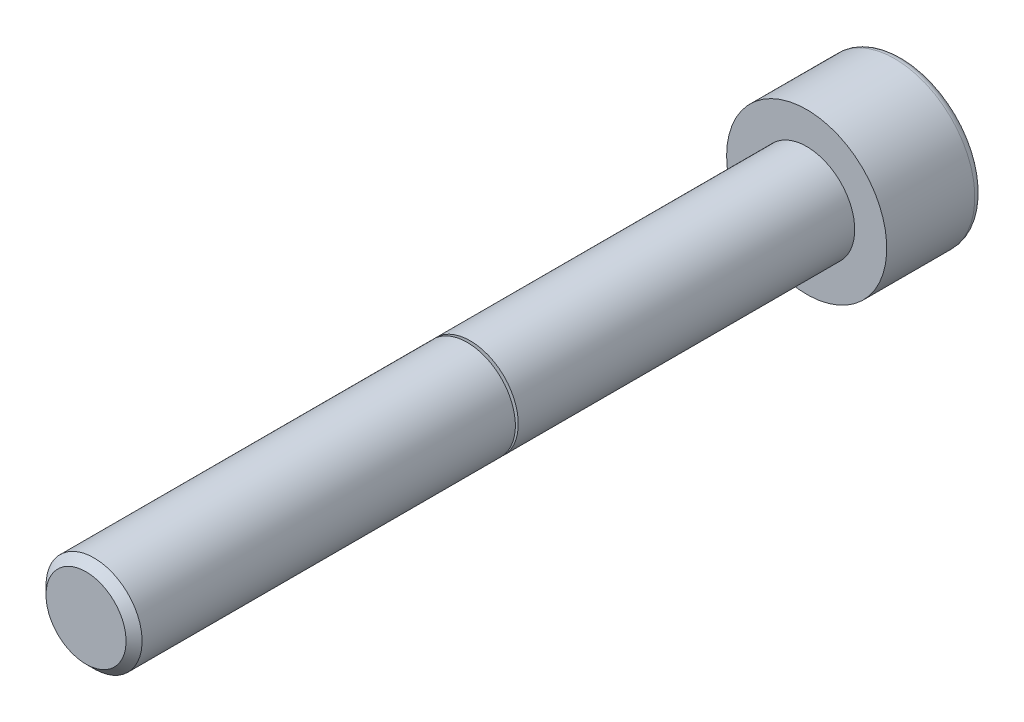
from build123d import *

# Parameters (mm, degrees)
CUT_EXTRUDE1_DEPTH = 2.5


with BuildPart() as part:
    # Logo3_bib1 → Revolve1 (revolve)
    with BuildSketch(Plane(origin=(0, 0, 0), x_dir=(-1, 0, 0), z_dir=(0, -1, 0))):
        with BuildLine():
            Line((0, -45), (0, 6))
            Line((0, 6), (4.5, 6))
            ThreePointArc((4.5, 6), (4.853553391, 5.853553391), (5, 5.5))
            Line((5, 5.5), (5, 0))
            Line((5, 0), (3, 0))
            Line((3, 0), (3, -21.01))
            Line((3, -21.01), (2.613425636, -21.01))
            ThreePointArc((2.613425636, -21.01), (2.593729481, -21.026527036), (2.606585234, -21.048793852))
            Line((2.606585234, -21.048793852), (3, -21.191985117))
            Line((3, -21.191985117), (3, -44.5))
            Line((3, -44.5), (2.5, -45))
            Line((2.5, -45), (0, -45))
        make_face()
    revolve(axis=Axis((0, 0, -10.585154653), (0, 0, 1)))

    # Logo3_bib2 → Cut-Extrude1 (cut)
    with BuildSketch(Plane(origin=(0, 0, -6), x_dir=(1, 0, 0), z_dir=(0, 0, -1))):
        Polygon((2.886751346, 0), (1.443375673, 2.5), (-1.443375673, 2.5), (-2.886751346, 0), (-1.443375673, -2.5), (1.443375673, -2.5), align=None)
    extrude(amount=-CUT_EXTRUDE1_DEPTH, mode=Mode.SUBTRACT)


solid = part.part
